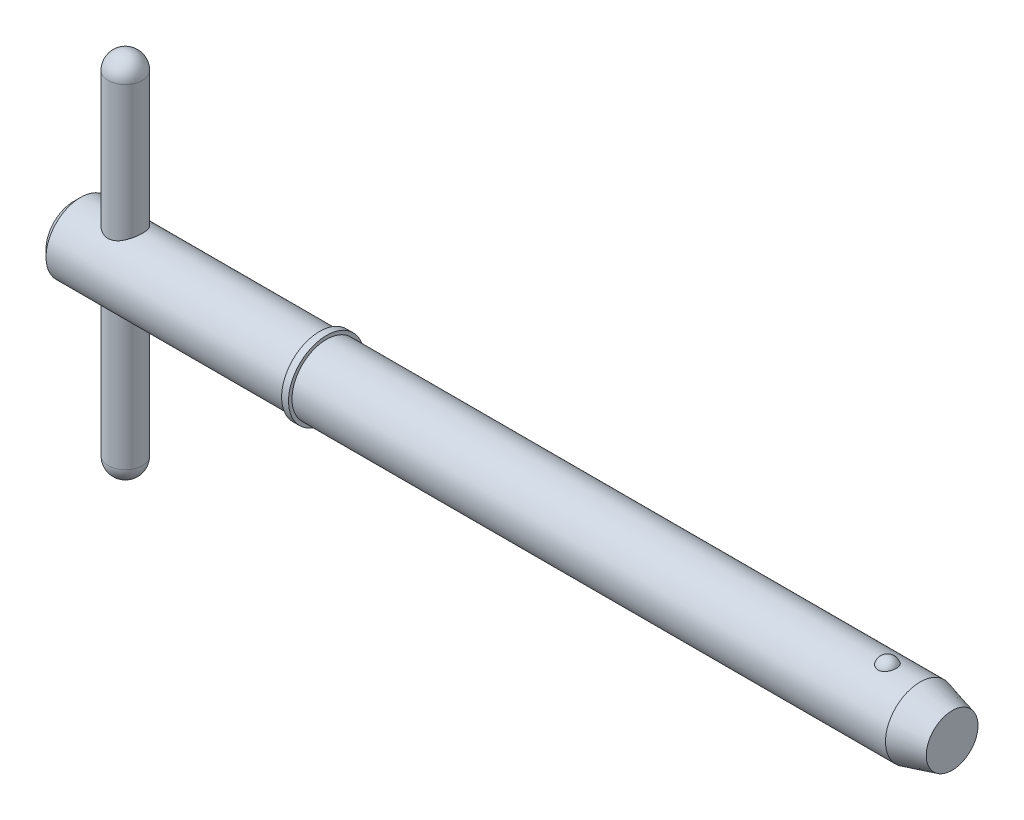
ISO-10303-21;
HEADER;
FILE_DESCRIPTION(('STEP AP214'),'2;1');
FILE_NAME('part.step','',(''),(''),'','','');
FILE_SCHEMA(('AUTOMOTIVE_DESIGN { 1 0 10303 214 1 1 1 1 }'));
ENDSEC;
DATA;
#1=APPLICATION_CONTEXT('core data for automotive mechanical design processes');
#2=APPLICATION_PROTOCOL_DEFINITION('international standard','automotive_design',2000,#1);
#3=PRODUCT_CONTEXT('',#1,'mechanical');
#4=PRODUCT('Part','Part','',(#3));
#5=PRODUCT_RELATED_PRODUCT_CATEGORY('part','',(#4));
#6=PRODUCT_DEFINITION_FORMATION('','',#4);
#7=PRODUCT_DEFINITION_CONTEXT('part definition',#1,'design');
#8=PRODUCT_DEFINITION('design','',#6,#7);
#9=PRODUCT_DEFINITION_SHAPE('','',#8);
#10=(LENGTH_UNIT() NAMED_UNIT(*) SI_UNIT(.MILLI.,.METRE.));
#11=(NAMED_UNIT(*) PLANE_ANGLE_UNIT() SI_UNIT($,.RADIAN.));
#12=(NAMED_UNIT(*) SI_UNIT($,.STERADIAN.) SOLID_ANGLE_UNIT());
#13=UNCERTAINTY_MEASURE_WITH_UNIT(LENGTH_MEASURE(1.E-05),#10,'distance_accuracy_value','');
#14=(GEOMETRIC_REPRESENTATION_CONTEXT(3) GLOBAL_UNCERTAINTY_ASSIGNED_CONTEXT((#13)) GLOBAL_UNIT_ASSIGNED_CONTEXT((#10,
#11,#12)) REPRESENTATION_CONTEXT('',''));
#15=CARTESIAN_POINT('',(0.,0.,0.));
#16=DIRECTION('',(0.,0.,1.));
#17=DIRECTION('',(1.,0.,0.));
#18=AXIS2_PLACEMENT_3D('',#15,#16,#17);
#19=CARTESIAN_POINT('',(3.57,12.7,0.));
#20=DIRECTION('',(0.,-1.,0.));
#21=DIRECTION('',(0.,0.,-1.));
#22=AXIS2_PLACEMENT_3D('',#19,#20,#21);
#23=CYLINDRICAL_SURFACE('',#22,1.19);
#24=CARTESIAN_POINT('',(3.57,-11.51,0.));
#25=DIRECTION('',(0.,-1.,0.));
#26=DIRECTION('',(0.,0.,-1.));
#27=AXIS2_PLACEMENT_3D('',#24,#25,#26);
#28=CIRCLE('',#27,1.19);
#29=CARTESIAN_POINT('',(3.57,-11.51,-1.19));
#30=VERTEX_POINT('',#29);
#31=EDGE_CURVE('P0_E10',#30,#30,#28,.F.);
#32=ORIENTED_EDGE('',*,*,#31,.T.);
#33=EDGE_LOOP('',(#32));
#34=FACE_BOUND('',#33,.T.);
#35=CARTESIAN_POINT('',(3.57,11.51,0.));
#36=DIRECTION('',(0.,-1.,0.));
#37=DIRECTION('',(0.,0.,-1.));
#38=AXIS2_PLACEMENT_3D('',#35,#36,#37);
#39=CIRCLE('',#38,1.19);
#40=CARTESIAN_POINT('',(3.57,11.51,-1.19));
#41=VERTEX_POINT('',#40);
#42=EDGE_CURVE('P0_E21',#41,#41,#39,.T.);
#43=ORIENTED_EDGE('',*,*,#42,.T.);
#44=EDGE_LOOP('',(#43));
#45=FACE_BOUND('',#44,.T.);
#46=ADVANCED_FACE('P0_F14',(#34,#45),#23,.T.);
#47=CARTESIAN_POINT('',(3.57,-11.51,0.));
#48=DIRECTION('',(0.,0.,1.));
#49=DIRECTION('',(1.,0.,0.));
#50=AXIS2_PLACEMENT_3D('',#47,#48,#49);
#51=SPHERICAL_SURFACE('',#50,1.19);
#52=CARTESIAN_POINT('',(3.57,-11.51,0.));
#53=DIRECTION('',(0.,-1.,0.));
#54=DIRECTION('',(0.,0.,-1.));
#55=AXIS2_PLACEMENT_3D('',#52,#53,#54);
#56=SPHERICAL_SURFACE('',#55,1.19);
#57=ORIENTED_EDGE('',*,*,#31,.F.);
#58=EDGE_LOOP('',(#57));
#59=FACE_BOUND('',#58,.T.);
#60=ADVANCED_FACE('P0_F29',(#59),#56,.T.);
#61=CARTESIAN_POINT('',(3.57,11.51,0.));
#62=DIRECTION('',(0.,0.,1.));
#63=DIRECTION('',(1.,0.,0.));
#64=AXIS2_PLACEMENT_3D('',#61,#62,#63);
#65=SPHERICAL_SURFACE('',#64,1.19);
#66=CARTESIAN_POINT('',(3.57,11.51,0.));
#67=DIRECTION('',(0.,-1.,0.));
#68=DIRECTION('',(0.,0.,-1.));
#69=AXIS2_PLACEMENT_3D('',#66,#67,#68);
#70=SPHERICAL_SURFACE('',#69,1.19);
#71=ORIENTED_EDGE('',*,*,#42,.F.);
#72=EDGE_LOOP('',(#71));
#73=FACE_BOUND('',#72,.T.);
#74=ADVANCED_FACE('P0_F16',(#73),#70,.T.);
#75=CLOSED_SHELL('',(#46,#60,#74));
#76=MANIFOLD_SOLID_BREP('P0_B1',#75);
#77=CARTESIAN_POINT('',(0.,0.,0.));
#78=DIRECTION('',(1.,0.,0.));
#79=DIRECTION('',(0.,0.,-1.));
#80=AXIS2_PLACEMENT_3D('',#77,#78,#79);
#81=CYLINDRICAL_SURFACE('',#80,2.38);
#82=CARTESIAN_POINT('',(58.4094297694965,0.,0.));
#83=DIRECTION('',(1.,0.,0.));
#84=DIRECTION('',(0.,0.,-1.));
#85=AXIS2_PLACEMENT_3D('',#82,#83,#84);
#86=CIRCLE('',#85,2.38);
#87=CARTESIAN_POINT('',(58.4094297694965,0.,-2.38));
#88=VERTEX_POINT('',#87);
#89=EDGE_CURVE('P1_E81',#88,#88,#86,.T.);
#90=ORIENTED_EDGE('',*,*,#89,.F.);
#91=EDGE_LOOP('',(#90));
#92=FACE_BOUND('',#91,.T.);
#93=CARTESIAN_POINT('',(17.45,0.,0.));
#94=DIRECTION('',(1.,0.,0.));
#95=DIRECTION('',(0.,0.,-1.));
#96=AXIS2_PLACEMENT_3D('',#93,#94,#95);
#97=CIRCLE('',#96,2.38);
#98=CARTESIAN_POINT('',(17.45,0.,-2.38));
#99=VERTEX_POINT('',#98);
#100=EDGE_CURVE('P1_E85',#99,#99,#97,.T.);
#101=ORIENTED_EDGE('',*,*,#100,.T.);
#102=EDGE_LOOP('',(#101));
#103=FACE_BOUND('',#102,.T.);
#104=CARTESIAN_POINT('',(56.1634492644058,2.2921568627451,0.640637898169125));
#105=CARTESIAN_POINT('',(56.1303559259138,2.29215737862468,0.640637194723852));
#106=CARTESIAN_POINT('',(56.0972546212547,2.29293179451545,0.637884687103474));
#107=CARTESIAN_POINT('',(56.0320176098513,2.29594030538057,0.626968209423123));
#108=CARTESIAN_POINT('',(55.9998823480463,2.29817506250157,0.618801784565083));
#109=CARTESIAN_POINT('',(55.9375402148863,2.30384308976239,0.597351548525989));
#110=CARTESIAN_POINT('',(55.9073305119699,2.30727454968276,0.584075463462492));
#111=CARTESIAN_POINT('',(55.8495674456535,2.31495941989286,0.552829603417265));
#112=CARTESIAN_POINT('',(55.8220141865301,2.31921286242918,0.534859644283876));
#113=CARTESIAN_POINT('',(55.7695938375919,2.32820213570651,0.494282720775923));
#114=CARTESIAN_POINT('',(55.7448050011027,2.33294694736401,0.471576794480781));
#115=CARTESIAN_POINT('',(55.6992169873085,2.34234144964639,0.422446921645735));
#116=CARTESIAN_POINT('',(55.6784185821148,2.34699112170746,0.396022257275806));
#117=CARTESIAN_POINT('',(55.6403580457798,2.35593942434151,0.338855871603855));
#118=CARTESIAN_POINT('',(55.6233051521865,2.36021170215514,0.30797060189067));
#119=CARTESIAN_POINT('',(55.5943607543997,2.3677057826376,0.243750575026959));
#120=CARTESIAN_POINT('',(55.5824701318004,2.37092740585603,0.210415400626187));
#121=CARTESIAN_POINT('',(55.5638076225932,2.37606901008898,0.141189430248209));
#122=CARTESIAN_POINT('',(55.5571956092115,2.37794816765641,0.105252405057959));
#123=CARTESIAN_POINT('',(55.5498095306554,2.38005135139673,0.0327351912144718));
#124=CARTESIAN_POINT('',(55.5490358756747,2.38027526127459,-0.00384504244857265));
#125=CARTESIAN_POINT('',(55.5533628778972,2.37903842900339,-0.0769838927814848));
#126=CARTESIAN_POINT('',(55.5585202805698,2.37756141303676,-0.113538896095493));
#127=CARTESIAN_POINT('',(55.5747013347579,2.37305303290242,-0.185229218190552));
#128=CARTESIAN_POINT('',(55.5857251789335,2.37002161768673,-0.220364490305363));
#129=CARTESIAN_POINT('',(55.6133977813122,2.36273722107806,-0.288156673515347));
#130=CARTESIAN_POINT('',(55.6300389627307,2.35848588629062,-0.32081685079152));
#131=CARTESIAN_POINT('',(55.6685984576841,2.34923130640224,-0.382744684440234));
#132=CARTESIAN_POINT('',(55.690516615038,2.34422808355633,-0.412012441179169));
#133=CARTESIAN_POINT('',(55.7387549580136,2.33412555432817,-0.465830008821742));
#134=CARTESIAN_POINT('',(55.765002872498,2.32902887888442,-0.490444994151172));
#135=CARTESIAN_POINT('',(55.8214769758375,2.31926941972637,-0.534700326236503));
#136=CARTESIAN_POINT('',(55.851702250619,2.3146065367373,-0.554341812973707));
#137=CARTESIAN_POINT('',(55.9140618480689,2.30645675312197,-0.58731242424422));
#138=CARTESIAN_POINT('',(55.9460780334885,2.30293152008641,-0.600855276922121));
#139=CARTESIAN_POINT('',(56.0120795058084,2.29725171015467,-0.622220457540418));
#140=CARTESIAN_POINT('',(56.0460641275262,2.29509667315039,-0.630044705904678));
#141=CARTESIAN_POINT('',(56.113299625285,2.29249264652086,-0.639452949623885));
#142=CARTESIAN_POINT('',(56.1465087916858,2.29196755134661,-0.641315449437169));
#143=CARTESIAN_POINT('',(56.2127631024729,2.29246849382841,-0.639522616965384));
#144=CARTESIAN_POINT('',(56.2458082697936,2.29349430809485,-0.635868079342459));
#145=CARTESIAN_POINT('',(56.3101025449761,2.29694059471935,-0.623301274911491));
#146=CARTESIAN_POINT('',(56.3413744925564,2.29933234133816,-0.61449721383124));
#147=CARTESIAN_POINT('',(56.4019952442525,2.30522511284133,-0.592006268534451));
#148=CARTESIAN_POINT('',(56.4313438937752,2.30872622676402,-0.578318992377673));
#149=CARTESIAN_POINT('',(56.4880369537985,2.31655795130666,-0.546112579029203));
#150=CARTESIAN_POINT('',(56.515320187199,2.32090569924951,-0.527490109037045));
#151=CARTESIAN_POINT('',(56.5664904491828,2.32992206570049,-0.486117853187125));
#152=CARTESIAN_POINT('',(56.5903767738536,2.33459075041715,-0.463367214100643));
#153=CARTESIAN_POINT('',(56.6352722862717,2.34399834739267,-0.413220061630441));
#154=CARTESIAN_POINT('',(56.6560972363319,2.34873051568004,-0.385657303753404));
#155=CARTESIAN_POINT('',(56.693056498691,2.35754932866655,-0.327455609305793));
#156=CARTESIAN_POINT('',(56.7091898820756,2.36163584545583,-0.29681606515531));
#157=CARTESIAN_POINT('',(56.7369822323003,2.36889321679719,-0.232047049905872));
#158=CARTESIAN_POINT('',(56.7484450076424,2.37202275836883,-0.197828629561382));
#159=CARTESIAN_POINT('',(56.7657523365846,2.37681926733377,-0.127900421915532));
#160=CARTESIAN_POINT('',(56.7715962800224,2.37848607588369,-0.0921904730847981));
#161=CARTESIAN_POINT('',(56.777605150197,2.38020024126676,-0.0196348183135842));
#162=CARTESIAN_POINT('',(56.7776704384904,2.38021918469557,0.0172198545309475));
#163=CARTESIAN_POINT('',(56.7718689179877,2.37856356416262,0.0904219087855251));
#164=CARTESIAN_POINT('',(56.7660018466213,2.37688892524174,0.126769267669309));
#165=CARTESIAN_POINT('',(56.748425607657,2.37201688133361,0.198028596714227));
#166=CARTESIAN_POINT('',(56.736699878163,2.36881516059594,0.232936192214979));
#167=CARTESIAN_POINT('',(56.7076354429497,2.36123444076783,0.300196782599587));
#168=CARTESIAN_POINT('',(56.6902967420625,2.3568554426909,0.332549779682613));
#169=CARTESIAN_POINT('',(56.6505350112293,2.34744667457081,0.393495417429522));
#170=CARTESIAN_POINT('',(56.6281528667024,2.34242227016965,0.422115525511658));
#171=CARTESIAN_POINT('',(56.5787391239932,2.33227293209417,0.475004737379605));
#172=CARTESIAN_POINT('',(56.5517076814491,2.32714800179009,0.499273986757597));
#173=CARTESIAN_POINT('',(56.4944988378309,2.31755359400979,0.54204602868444));
#174=CARTESIAN_POINT('',(56.4644297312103,2.3130698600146,0.560690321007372));
#175=CARTESIAN_POINT('',(56.4013869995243,2.3051412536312,0.592447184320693));
#176=CARTESIAN_POINT('',(56.3684158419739,2.30169550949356,0.605564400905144));
#177=CARTESIAN_POINT('',(56.3068424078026,2.29677744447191,0.623927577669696));
#178=CARTESIAN_POINT('',(56.2785555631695,2.29505839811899,0.63017893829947));
#179=CARTESIAN_POINT('',(56.2213308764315,2.29274795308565,0.638534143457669));
#180=CARTESIAN_POINT('',(56.1923931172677,2.29215641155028,0.640638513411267));
#181=CARTESIAN_POINT('',(56.1634492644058,2.2921568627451,0.640637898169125));
#182=B_SPLINE_CURVE_WITH_KNOTS('',3,(#104,#105,#106,#107,#108,#109,#110,#111,#112,#113,#114,
#115,#116,#117,#118,#119,#120,#121,#122,#123,#124,#125,#126,#127,#128,#129,#130,#131,#132,#133,
#134,#135,#136,#137,#138,#139,#140,#141,#142,#143,#144,#145,#146,#147,#148,#149,#150,#151,#152,
#153,#154,#155,#156,#157,#158,#159,#160,#161,#162,#163,#164,#165,#166,#167,#168,#169,#170,#171,
#172,#173,#174,#175,#176,#177,#178,#179,#180,#181),.UNSPECIFIED.,.T.,.F.,(4,2,2,2,2,2,2,2,2,2,2,
2,2,2,2,2,2,2,2,2,2,2,2,2,2,2,2,2,2,2,2,2,2,2,2,2,2,2,4),(0.,0.0991724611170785,
0.198389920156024,0.297457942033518,0.396529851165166,0.497927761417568,0.599345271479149,
0.705475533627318,0.811623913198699,0.92087671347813,1.03013718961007,1.14045177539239,
1.25076998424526,1.36093998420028,1.47110672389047,1.57959248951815,1.6880533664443,
1.79234266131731,1.89659691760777,1.9959039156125,2.09519661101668,2.1924742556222,
2.28975970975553,2.38926978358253,2.48880044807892,2.59293588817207,2.6970919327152,
2.8052582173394,2.91343624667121,3.02347917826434,3.13352698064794,3.24388765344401,
3.35424823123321,3.46374443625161,3.57323697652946,3.67968690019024,3.78604717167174,
3.87279565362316,3.95953314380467),.UNSPECIFIED.);
#183=CARTESIAN_POINT('',(56.1634492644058,2.2921568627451,0.640637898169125));
#184=VERTEX_POINT('',#183);
#185=EDGE_CURVE('P1_E35',#184,#184,#182,.T.);
#186=ORIENTED_EDGE('',*,*,#185,.T.);
#187=EDGE_LOOP('',(#186));
#188=FACE_BOUND('',#187,.T.);
#189=ADVANCED_FACE('P1_F13',(#92,#103,#188),#81,.T.);
#190=CARTESIAN_POINT('',(0.,0.,0.));
#191=DIRECTION('',(-1.,0.,0.));
#192=DIRECTION('',(0.,0.,1.));
#193=AXIS2_PLACEMENT_3D('',#190,#191,#192);
#194=PLANE('',#193);
#195=CARTESIAN_POINT('',(0.,0.,0.));
#196=DIRECTION('',(1.,0.,0.));
#197=DIRECTION('',(0.,0.,-1.));
#198=AXIS2_PLACEMENT_3D('',#195,#196,#197);
#199=CIRCLE('',#198,1.904);
#200=CARTESIAN_POINT('',(0.,0.,-1.904));
#201=VERTEX_POINT('',#200);
#202=EDGE_CURVE('P1_E9',#201,#201,#199,.T.);
#203=ORIENTED_EDGE('',*,*,#202,.F.);
#204=EDGE_LOOP('',(#203));
#205=FACE_BOUND('',#204,.T.);
#206=ADVANCED_FACE('P1_F15',(#205),#194,.T.);
#207=CARTESIAN_POINT('',(0.475999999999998,0.,0.));
#208=DIRECTION('',(1.,0.,0.));
#209=DIRECTION('',(0.,0.,-1.));
#210=AXIS2_PLACEMENT_3D('',#207,#208,#209);
#211=CONICAL_SURFACE('',#210,2.38,0.78539816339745);
#212=ORIENTED_EDGE('',*,*,#202,.T.);
#213=EDGE_LOOP('',(#212));
#214=FACE_BOUND('',#213,.T.);
#215=CARTESIAN_POINT('',(0.475999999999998,0.,0.));
#216=DIRECTION('',(1.,0.,0.));
#217=DIRECTION('',(0.,0.,-1.));
#218=AXIS2_PLACEMENT_3D('',#215,#216,#217);
#219=CIRCLE('',#218,2.38);
#220=CARTESIAN_POINT('',(0.475999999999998,0.,-2.38));
#221=VERTEX_POINT('',#220);
#222=EDGE_CURVE('P1_E26',#221,#221,#219,.T.);
#223=ORIENTED_EDGE('',*,*,#222,.F.);
#224=EDGE_LOOP('',(#223));
#225=FACE_BOUND('',#224,.T.);
#226=ADVANCED_FACE('P1_F77',(#214,#225),#211,.T.);
#227=CARTESIAN_POINT('',(0.,0.,0.));
#228=DIRECTION('',(1.,0.,0.));
#229=DIRECTION('',(0.,0.,-1.));
#230=AXIS2_PLACEMENT_3D('',#227,#228,#229);
#231=CYLINDRICAL_SURFACE('',#230,2.38);
#232=CARTESIAN_POINT('',(3.57,-2.06114046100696,1.19));
#233=CARTESIAN_POINT('',(3.50799170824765,-2.06114586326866,1.18999567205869));
#234=CARTESIAN_POINT('',(3.4459051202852,-2.0639812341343,1.18512096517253));
#235=CARTESIAN_POINT('',(3.32363755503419,-2.07491216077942,1.16587061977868));
#236=CARTESIAN_POINT('',(3.26346086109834,-2.08301876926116,1.15147501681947));
#237=CARTESIAN_POINT('',(3.14701251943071,-2.10331722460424,1.11395893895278));
#238=CARTESIAN_POINT('',(3.09072196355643,-2.1154873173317,1.09088484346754));
#239=CARTESIAN_POINT('',(2.9828251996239,-2.14250771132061,1.03680835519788));
#240=CARTESIAN_POINT('',(2.93121924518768,-2.15735815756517,1.00580553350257));
#241=CARTESIAN_POINT('',(2.82945618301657,-2.18956274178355,0.933753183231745));
#242=CARTESIAN_POINT('',(2.77976962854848,-2.20702235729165,0.892085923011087));
#243=CARTESIAN_POINT('',(2.68772401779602,-2.2416265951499,0.801172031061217));
#244=CARTESIAN_POINT('',(2.64536861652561,-2.25877105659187,0.751921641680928));
#245=CARTESIAN_POINT('',(2.56639309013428,-2.29219557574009,0.64318258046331));
#246=CARTESIAN_POINT('',(2.53035201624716,-2.30833946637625,0.583227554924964));
#247=CARTESIAN_POINT('',(2.46908238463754,-2.3365739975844,0.45714686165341));
#248=CARTESIAN_POINT('',(2.44384700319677,-2.34866719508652,0.391025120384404));
#249=CARTESIAN_POINT('',(2.40676945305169,-2.36667748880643,0.259473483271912));
#250=CARTESIAN_POINT('',(2.39410206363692,-2.37297281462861,0.194329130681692));
#251=CARTESIAN_POINT('',(2.3798023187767,-2.3800902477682,0.0625590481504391));
#252=CARTESIAN_POINT('',(2.37816328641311,-2.38091566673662,-0.00406576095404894));
#253=CARTESIAN_POINT('',(2.38564854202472,-2.37717948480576,-0.130700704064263));
#254=CARTESIAN_POINT('',(2.39384923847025,-2.37308010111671,-0.190782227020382));
#255=CARTESIAN_POINT('',(2.41912820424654,-2.360653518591,-0.308583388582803));
#256=CARTESIAN_POINT('',(2.43620713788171,-2.35232600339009,-0.366302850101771));
#257=CARTESIAN_POINT('',(2.47886825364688,-2.33206184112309,-0.478748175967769));
#258=CARTESIAN_POINT('',(2.50456481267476,-2.32007685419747,-0.533421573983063));
#259=CARTESIAN_POINT('',(2.56357346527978,-2.29357798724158,-0.637812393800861));
#260=CARTESIAN_POINT('',(2.5968882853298,-2.27906320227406,-0.687528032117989));
#261=CARTESIAN_POINT('',(2.67380546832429,-2.24724829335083,-0.785606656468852));
#262=CARTESIAN_POINT('',(2.71808260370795,-2.22981457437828,-0.833397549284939));
#263=CARTESIAN_POINT('',(2.81386177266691,-2.19500665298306,-0.921184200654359));
#264=CARTESIAN_POINT('',(2.86536931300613,-2.17763250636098,-0.961173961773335));
#265=CARTESIAN_POINT('',(2.97815134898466,-2.14371545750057,-1.03471134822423));
#266=CARTESIAN_POINT('',(3.03983836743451,-2.12729540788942,-1.06768860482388));
#267=CARTESIAN_POINT('',(3.16889582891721,-2.09886785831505,-1.12254974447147));
#268=CARTESIAN_POINT('',(3.2362602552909,-2.0868557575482,-1.14444520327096));
#269=CARTESIAN_POINT('',(3.36914526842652,-2.06994116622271,-1.1747444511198));
#270=CARTESIAN_POINT('',(3.43438893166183,-2.06455070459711,-1.18407989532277));
#271=CARTESIAN_POINT('',(3.56571759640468,-2.06010324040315,-1.1918051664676));
#272=CARTESIAN_POINT('',(3.63180197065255,-2.06104176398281,-1.19020272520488));
#273=CARTESIAN_POINT('',(3.75522816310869,-2.06862860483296,-1.17695289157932));
#274=CARTESIAN_POINT('',(3.81273554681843,-2.07464109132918,-1.16642350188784));
#275=CARTESIAN_POINT('',(3.92505766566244,-2.09075885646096,-1.1372785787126));
#276=CARTESIAN_POINT('',(3.97987152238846,-2.1008654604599,-1.1186604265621));
#277=CARTESIAN_POINT('',(4.08813948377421,-2.12458104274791,-1.07296063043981));
#278=CARTESIAN_POINT('',(4.14141303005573,-2.13833055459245,-1.04552693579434));
#279=CARTESIAN_POINT('',(4.2429084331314,-2.16765782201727,-0.983281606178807));
#280=CARTESIAN_POINT('',(4.29112767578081,-2.18323651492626,-0.948466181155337));
#281=CARTESIAN_POINT('',(4.38750473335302,-2.2168271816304,-0.867316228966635));
#282=CARTESIAN_POINT('',(4.43488860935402,-2.23489833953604,-0.82008287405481));
#283=CARTESIAN_POINT('',(4.52130056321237,-2.26973739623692,-0.718051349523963));
#284=CARTESIAN_POINT('',(4.56032581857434,-2.28650485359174,-0.663250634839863));
#285=CARTESIAN_POINT('',(4.62978273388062,-2.31742220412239,-0.545657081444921));
#286=CARTESIAN_POINT('',(4.65996041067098,-2.33149133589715,-0.482691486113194));
#287=CARTESIAN_POINT('',(4.7089941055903,-2.35481192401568,-0.351671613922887));
#288=CARTESIAN_POINT('',(4.7278600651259,-2.36406760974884,-0.283621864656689));
#289=CARTESIAN_POINT('',(4.75210859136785,-2.3760433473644,-0.151105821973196));
#290=CARTESIAN_POINT('',(4.75856947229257,-2.37928514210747,-0.0868836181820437));
#291=CARTESIAN_POINT('',(4.76100348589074,-2.38050135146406,0.0417999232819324));
#292=CARTESIAN_POINT('',(4.75698028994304,-2.37847760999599,0.106261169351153));
#293=CARTESIAN_POINT('',(4.73927447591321,-2.36969422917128,0.229120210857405));
#294=CARTESIAN_POINT('',(4.72624582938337,-2.36325544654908,0.287637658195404));
#295=CARTESIAN_POINT('',(4.69178087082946,-2.34658591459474,0.401560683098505));
#296=CARTESIAN_POINT('',(4.67034335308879,-2.33635462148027,0.456965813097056));
#297=CARTESIAN_POINT('',(4.61871480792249,-2.31247857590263,0.565753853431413));
#298=CARTESIAN_POINT('',(4.58818860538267,-2.29870654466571,0.618948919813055));
#299=CARTESIAN_POINT('',(4.51967006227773,-2.26918878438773,0.719681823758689));
#300=CARTESIAN_POINT('',(4.48167429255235,-2.25344215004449,0.76721704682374));
#301=CARTESIAN_POINT('',(4.39491140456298,-2.21969046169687,0.860267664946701));
#302=CARTESIAN_POINT('',(4.34544863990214,-2.20161660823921,0.905111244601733));
#303=CARTESIAN_POINT('',(4.23943364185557,-2.16655060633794,0.986109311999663));
#304=CARTESIAN_POINT('',(4.18287520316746,-2.1495594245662,1.02225611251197));
#305=CARTESIAN_POINT('',(4.06190239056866,-2.1181953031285,1.08579298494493));
#306=CARTESIAN_POINT('',(3.9972962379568,-2.10392207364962,1.11287022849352));
#307=CARTESIAN_POINT('',(3.86353443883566,-2.08090726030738,1.15534566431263));
#308=CARTESIAN_POINT('',(3.7943948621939,-2.07214719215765,1.17078291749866));
#309=CARTESIAN_POINT('',(3.69875162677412,-2.06499834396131,1.18329673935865));
#310=CARTESIAN_POINT('',(3.67309220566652,-2.06355673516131,1.18580656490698));
#311=CARTESIAN_POINT('',(3.62162638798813,-2.06162663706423,1.18915915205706));
#312=CARTESIAN_POINT('',(3.59581998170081,-2.0611382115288,1.19000180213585));
#313=CARTESIAN_POINT('',(3.57,-2.06114046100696,1.19));
#314=B_SPLINE_CURVE_WITH_KNOTS('',3,(#232,#233,#234,#235,#236,#237,#238,#239,#240,#241,#242,
#243,#244,#245,#246,#247,#248,#249,#250,#251,#252,#253,#254,#255,#256,#257,#258,#259,#260,#261,
#262,#263,#264,#265,#266,#267,#268,#269,#270,#271,#272,#273,#274,#275,#276,#277,#278,#279,#280,
#281,#282,#283,#284,#285,#286,#287,#288,#289,#290,#291,#292,#293,#294,#295,#296,#297,#298,#299,
#300,#301,#302,#303,#304,#305,#306,#307,#308,#309,#310,#311,#312,#313),.UNSPECIFIED.,.T.,.F.,(4,
2,2,2,2,2,2,2,2,2,2,2,2,2,2,2,2,2,2,2,2,2,2,2,2,2,2,2,2,2,2,2,2,2,2,2,2,2,2,2,4),(0.,
0.185916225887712,0.372223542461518,0.557549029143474,0.742884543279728,0.943506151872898,
1.14422749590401,1.35847891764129,1.5725948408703,1.77147547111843,1.97023568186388,
2.15171156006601,2.33320101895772,2.51720146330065,2.70126786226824,2.902733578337,
3.10435357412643,3.31877721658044,3.53297641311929,3.73020126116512,3.92728670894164,
4.1028127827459,4.27839572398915,4.46211082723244,4.64592048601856,4.8529002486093,
5.0599497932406,5.27246375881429,5.48479067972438,5.67763601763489,5.87041383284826,
6.05048865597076,6.23058930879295,6.41839293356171,6.60628297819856,6.8128718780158,
7.01964271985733,7.2329479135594,7.44553408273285,7.52294360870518,7.60035831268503),.UNSPECIFIED.);
#315=CARTESIAN_POINT('',(3.57,-2.06114046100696,1.19));
#316=VERTEX_POINT('',#315);
#317=EDGE_CURVE('P1_E17',#316,#316,#314,.T.);
#318=ORIENTED_EDGE('',*,*,#317,.F.);
#319=EDGE_LOOP('',(#318));
#320=FACE_BOUND('',#319,.T.);
#321=CARTESIAN_POINT('',(3.57,2.06114046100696,1.19));
#322=CARTESIAN_POINT('',(3.63200829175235,2.06114586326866,1.18999567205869));
#323=CARTESIAN_POINT('',(3.6940948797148,2.0639812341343,1.18512096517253));
#324=CARTESIAN_POINT('',(3.81636244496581,2.07491216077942,1.16587061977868));
#325=CARTESIAN_POINT('',(3.87653913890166,2.08301876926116,1.15147501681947));
#326=CARTESIAN_POINT('',(3.99298748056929,2.10331722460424,1.11395893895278));
#327=CARTESIAN_POINT('',(4.04927803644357,2.1154873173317,1.09088484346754));
#328=CARTESIAN_POINT('',(4.1571748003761,2.14250771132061,1.03680835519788));
#329=CARTESIAN_POINT('',(4.20878075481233,2.15735815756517,1.00580553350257));
#330=CARTESIAN_POINT('',(4.31054381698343,2.18956274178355,0.933753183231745));
#331=CARTESIAN_POINT('',(4.36023037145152,2.20702235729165,0.892085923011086));
#332=CARTESIAN_POINT('',(4.45227598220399,2.2416265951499,0.801172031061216));
#333=CARTESIAN_POINT('',(4.49463138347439,2.25877105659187,0.751921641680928));
#334=CARTESIAN_POINT('',(4.57360690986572,2.29219557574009,0.643182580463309));
#335=CARTESIAN_POINT('',(4.60964798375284,2.30833946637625,0.583227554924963));
#336=CARTESIAN_POINT('',(4.67091761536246,2.3365739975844,0.457146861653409));
#337=CARTESIAN_POINT('',(4.69615299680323,2.34866719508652,0.391025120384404));
#338=CARTESIAN_POINT('',(4.73323054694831,2.36667748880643,0.259473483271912));
#339=CARTESIAN_POINT('',(4.74589793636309,2.37297281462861,0.194329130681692));
#340=CARTESIAN_POINT('',(4.7601976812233,2.3800902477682,0.0625590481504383));
#341=CARTESIAN_POINT('',(4.76183671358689,2.38091566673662,-0.00406576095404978));
#342=CARTESIAN_POINT('',(4.75435145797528,2.37717948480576,-0.130700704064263));
#343=CARTESIAN_POINT('',(4.74615076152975,2.37308010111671,-0.190782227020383));
#344=CARTESIAN_POINT('',(4.72087179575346,2.360653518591,-0.308583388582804));
#345=CARTESIAN_POINT('',(4.70379286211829,2.35232600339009,-0.366302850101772));
#346=CARTESIAN_POINT('',(4.66113174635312,2.33206184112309,-0.478748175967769));
#347=CARTESIAN_POINT('',(4.63543518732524,2.32007685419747,-0.533421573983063));
#348=CARTESIAN_POINT('',(4.57642653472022,2.29357798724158,-0.637812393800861));
#349=CARTESIAN_POINT('',(4.5431117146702,2.27906320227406,-0.687528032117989));
#350=CARTESIAN_POINT('',(4.46619453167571,2.24724829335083,-0.785606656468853));
#351=CARTESIAN_POINT('',(4.42191739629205,2.22981457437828,-0.83339754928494));
#352=CARTESIAN_POINT('',(4.32613822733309,2.19500665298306,-0.921184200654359));
#353=CARTESIAN_POINT('',(4.27463068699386,2.17763250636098,-0.961173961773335));
#354=CARTESIAN_POINT('',(4.16184865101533,2.14371545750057,-1.03471134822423));
#355=CARTESIAN_POINT('',(4.10016163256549,2.12729540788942,-1.06768860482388));
#356=CARTESIAN_POINT('',(3.97110417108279,2.09886785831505,-1.12254974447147));
#357=CARTESIAN_POINT('',(3.9037397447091,2.0868557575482,-1.14444520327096));
#358=CARTESIAN_POINT('',(3.77085473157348,2.06994116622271,-1.1747444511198));
#359=CARTESIAN_POINT('',(3.70561106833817,2.06455070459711,-1.18407989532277));
#360=CARTESIAN_POINT('',(3.57428240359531,2.06010324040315,-1.1918051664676));
#361=CARTESIAN_POINT('',(3.50819802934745,2.06104176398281,-1.19020272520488));
#362=CARTESIAN_POINT('',(3.38477183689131,2.06862860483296,-1.17695289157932));
#363=CARTESIAN_POINT('',(3.32726445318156,2.07464109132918,-1.16642350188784));
#364=CARTESIAN_POINT('',(3.21494233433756,2.09075885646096,-1.1372785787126));
#365=CARTESIAN_POINT('',(3.16012847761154,2.1008654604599,-1.1186604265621));
#366=CARTESIAN_POINT('',(3.05186051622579,2.12458104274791,-1.07296063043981));
#367=CARTESIAN_POINT('',(2.99858696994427,2.13833055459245,-1.04552693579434));
#368=CARTESIAN_POINT('',(2.8970915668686,2.16765782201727,-0.983281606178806));
#369=CARTESIAN_POINT('',(2.84887232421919,2.18323651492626,-0.948466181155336));
#370=CARTESIAN_POINT('',(2.75249526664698,2.2168271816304,-0.867316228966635));
#371=CARTESIAN_POINT('',(2.70511139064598,2.23489833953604,-0.820082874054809));
#372=CARTESIAN_POINT('',(2.61869943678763,2.26973739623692,-0.718051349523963));
#373=CARTESIAN_POINT('',(2.57967418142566,2.28650485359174,-0.663250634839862));
#374=CARTESIAN_POINT('',(2.51021726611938,2.31742220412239,-0.54565708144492));
#375=CARTESIAN_POINT('',(2.48003958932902,2.33149133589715,-0.482691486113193));
#376=CARTESIAN_POINT('',(2.4310058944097,2.35481192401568,-0.351671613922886));
#377=CARTESIAN_POINT('',(2.4121399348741,2.36406760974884,-0.283621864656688));
#378=CARTESIAN_POINT('',(2.38789140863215,2.3760433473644,-0.151105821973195));
#379=CARTESIAN_POINT('',(2.38143052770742,2.37928514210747,-0.0868836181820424));
#380=CARTESIAN_POINT('',(2.37899651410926,2.38050135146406,0.0417999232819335));
#381=CARTESIAN_POINT('',(2.38301971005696,2.37847760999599,0.106261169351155));
#382=CARTESIAN_POINT('',(2.40072552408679,2.36969422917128,0.229120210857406));
#383=CARTESIAN_POINT('',(2.41375417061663,2.36325544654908,0.287637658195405));
#384=CARTESIAN_POINT('',(2.44821912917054,2.34658591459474,0.401560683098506));
#385=CARTESIAN_POINT('',(2.46965664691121,2.33635462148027,0.456965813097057));
#386=CARTESIAN_POINT('',(2.52128519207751,2.31247857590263,0.565753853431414));
#387=CARTESIAN_POINT('',(2.55181139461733,2.29870654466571,0.618948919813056));
#388=CARTESIAN_POINT('',(2.62032993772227,2.26918878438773,0.719681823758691));
#389=CARTESIAN_POINT('',(2.65832570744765,2.25344215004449,0.767217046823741));
#390=CARTESIAN_POINT('',(2.74508859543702,2.21969046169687,0.860267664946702));
#391=CARTESIAN_POINT('',(2.79455136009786,2.20161660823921,0.905111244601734));
#392=CARTESIAN_POINT('',(2.90056635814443,2.16655060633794,0.986109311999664));
#393=CARTESIAN_POINT('',(2.95712479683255,2.1495594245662,1.02225611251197));
#394=CARTESIAN_POINT('',(3.07809760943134,2.1181953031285,1.08579298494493));
#395=CARTESIAN_POINT('',(3.1427037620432,2.10392207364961,1.11287022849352));
#396=CARTESIAN_POINT('',(3.27646556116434,2.08090726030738,1.15534566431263));
#397=CARTESIAN_POINT('',(3.3456051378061,2.07214719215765,1.17078291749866));
#398=CARTESIAN_POINT('',(3.44124837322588,2.06499834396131,1.18329673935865));
#399=CARTESIAN_POINT('',(3.46690779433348,2.06355673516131,1.18580656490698));
#400=CARTESIAN_POINT('',(3.51837361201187,2.06162663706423,1.18915915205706));
#401=CARTESIAN_POINT('',(3.54418001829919,2.0611382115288,1.19000180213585));
#402=CARTESIAN_POINT('',(3.57,2.06114046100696,1.19));
#403=B_SPLINE_CURVE_WITH_KNOTS('',3,(#321,#322,#323,#324,#325,#326,#327,#328,#329,#330,#331,
#332,#333,#334,#335,#336,#337,#338,#339,#340,#341,#342,#343,#344,#345,#346,#347,#348,#349,#350,
#351,#352,#353,#354,#355,#356,#357,#358,#359,#360,#361,#362,#363,#364,#365,#366,#367,#368,#369,
#370,#371,#372,#373,#374,#375,#376,#377,#378,#379,#380,#381,#382,#383,#384,#385,#386,#387,#388,
#389,#390,#391,#392,#393,#394,#395,#396,#397,#398,#399,#400,#401,#402),.UNSPECIFIED.,.T.,.F.,(4,
2,2,2,2,2,2,2,2,2,2,2,2,2,2,2,2,2,2,2,2,2,2,2,2,2,2,2,2,2,2,2,2,2,2,2,2,2,2,2,4),(0.,
0.185916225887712,0.372223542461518,0.557549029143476,0.74288454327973,0.9435061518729,
1.14422749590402,1.35847891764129,1.5725948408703,1.77147547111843,1.97023568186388,
2.15171156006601,2.33320101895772,2.51720146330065,2.70126786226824,2.902733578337,
3.10435357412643,3.31877721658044,3.53297641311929,3.73020126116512,3.92728670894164,
4.1028127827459,4.27839572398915,4.46211082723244,4.64592048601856,4.8529002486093,
5.05994979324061,5.27246375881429,5.48479067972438,5.67763601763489,5.87041383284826,
6.05048865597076,6.23058930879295,6.41839293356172,6.60628297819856,6.8128718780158,
7.01964271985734,7.2329479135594,7.44553408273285,7.52294360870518,7.60035831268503),.UNSPECIFIED.);
#404=CARTESIAN_POINT('',(3.57,2.06114046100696,1.19));
#405=VERTEX_POINT('',#404);
#406=EDGE_CURVE('P1_E43',#405,#405,#403,.T.);
#407=ORIENTED_EDGE('',*,*,#406,.F.);
#408=EDGE_LOOP('',(#407));
#409=FACE_BOUND('',#408,.T.);
#410=ORIENTED_EDGE('',*,*,#222,.T.);
#411=EDGE_LOOP('',(#410));
#412=FACE_BOUND('',#411,.T.);
#413=CARTESIAN_POINT('',(16.974,0.,0.));
#414=DIRECTION('',(1.,0.,0.));
#415=DIRECTION('',(0.,0.,-1.));
#416=AXIS2_PLACEMENT_3D('',#413,#414,#415);
#417=CIRCLE('',#416,2.38);
#418=CARTESIAN_POINT('',(16.974,0.,-2.38));
#419=VERTEX_POINT('',#418);
#420=EDGE_CURVE('P1_E31',#419,#419,#417,.T.);
#421=ORIENTED_EDGE('',*,*,#420,.F.);
#422=EDGE_LOOP('',(#421));
#423=FACE_BOUND('',#422,.T.);
#424=ADVANCED_FACE('P1_F103',(#320,#409,#412,#423),#231,.T.);
#425=CARTESIAN_POINT('',(16.974,2.38,0.));
#426=DIRECTION('',(-1.,0.,0.));
#427=DIRECTION('',(0.,0.,1.));
#428=AXIS2_PLACEMENT_3D('',#425,#426,#427);
#429=PLANE('',#428);
#430=ORIENTED_EDGE('',*,*,#420,.T.);
#431=EDGE_LOOP('',(#430));
#432=FACE_BOUND('',#431,.T.);
#433=CARTESIAN_POINT('',(16.974,0.,0.));
#434=DIRECTION('',(1.,0.,0.));
#435=DIRECTION('',(0.,0.,-1.));
#436=AXIS2_PLACEMENT_3D('',#433,#434,#435);
#437=CIRCLE('',#436,2.618);
#438=CARTESIAN_POINT('',(16.974,0.,-2.618));
#439=VERTEX_POINT('',#438);
#440=EDGE_CURVE('P1_E91',#439,#439,#437,.T.);
#441=ORIENTED_EDGE('',*,*,#440,.F.);
#442=EDGE_LOOP('',(#441));
#443=FACE_BOUND('',#442,.T.);
#444=ADVANCED_FACE('P1_F100',(#432,#443),#429,.T.);
#445=CARTESIAN_POINT('',(0.,0.,0.));
#446=DIRECTION('',(1.,0.,0.));
#447=DIRECTION('',(0.,0.,-1.));
#448=AXIS2_PLACEMENT_3D('',#445,#446,#447);
#449=CYLINDRICAL_SURFACE('',#448,2.618);
#450=ORIENTED_EDGE('',*,*,#440,.T.);
#451=EDGE_LOOP('',(#450));
#452=FACE_BOUND('',#451,.T.);
#453=CARTESIAN_POINT('',(17.45,0.,0.));
#454=DIRECTION('',(1.,0.,0.));
#455=DIRECTION('',(0.,0.,-1.));
#456=AXIS2_PLACEMENT_3D('',#453,#454,#455);
#457=CIRCLE('',#456,2.618);
#458=CARTESIAN_POINT('',(17.45,0.,-2.618));
#459=VERTEX_POINT('',#458);
#460=EDGE_CURVE('P1_E88',#459,#459,#457,.T.);
#461=ORIENTED_EDGE('',*,*,#460,.F.);
#462=EDGE_LOOP('',(#461));
#463=FACE_BOUND('',#462,.T.);
#464=ADVANCED_FACE('P1_F68',(#452,#463),#449,.T.);
#465=CARTESIAN_POINT('',(17.45,2.618,0.));
#466=DIRECTION('',(1.,0.,0.));
#467=DIRECTION('',(0.,0.,-1.));
#468=AXIS2_PLACEMENT_3D('',#465,#466,#467);
#469=PLANE('',#468);
#470=ORIENTED_EDGE('',*,*,#460,.T.);
#471=EDGE_LOOP('',(#470));
#472=FACE_BOUND('',#471,.T.);
#473=ORIENTED_EDGE('',*,*,#100,.F.);
#474=EDGE_LOOP('',(#473));
#475=FACE_BOUND('',#474,.T.);
#476=ADVANCED_FACE('P1_F62',(#472,#475),#469,.T.);
#477=CARTESIAN_POINT('',(60.63,0.,0.));
#478=DIRECTION('',(-1.,0.,0.));
#479=DIRECTION('',(0.,0.,1.));
#480=AXIS2_PLACEMENT_3D('',#477,#478,#479);
#481=CONICAL_SURFACE('',#480,1.78500000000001,0.261799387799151);
#482=ORIENTED_EDGE('',*,*,#89,.T.);
#483=EDGE_LOOP('',(#482));
#484=FACE_BOUND('',#483,.T.);
#485=CARTESIAN_POINT('',(60.63,0.,0.));
#486=DIRECTION('',(1.,0.,0.));
#487=DIRECTION('',(0.,0.,-1.));
#488=AXIS2_PLACEMENT_3D('',#485,#486,#487);
#489=CIRCLE('',#488,1.78500000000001);
#490=CARTESIAN_POINT('',(60.63,0.,-1.78500000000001));
#491=VERTEX_POINT('',#490);
#492=EDGE_CURVE('P1_E42',#491,#491,#489,.T.);
#493=ORIENTED_EDGE('',*,*,#492,.F.);
#494=EDGE_LOOP('',(#493));
#495=FACE_BOUND('',#494,.T.);
#496=ADVANCED_FACE('P1_F59',(#484,#495),#481,.T.);
#497=CARTESIAN_POINT('',(60.63,1.78500000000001,0.));
#498=DIRECTION('',(1.,0.,0.));
#499=DIRECTION('',(0.,0.,-1.));
#500=AXIS2_PLACEMENT_3D('',#497,#498,#499);
#501=PLANE('',#500);
#502=ORIENTED_EDGE('',*,*,#492,.T.);
#503=EDGE_LOOP('',(#502));
#504=FACE_BOUND('',#503,.T.);
#505=ADVANCED_FACE('P1_F55',(#504),#501,.T.);
#506=CARTESIAN_POINT('',(56.1634492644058,2.142,0.));
#507=DIRECTION('',(-1.,0.,0.));
#508=DIRECTION('',(0.,-1.,0.));
#509=AXIS2_PLACEMENT_3D('',#506,#507,#508);
#510=SPHERICAL_SURFACE('',#509,0.658000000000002);
#511=ORIENTED_EDGE('',*,*,#185,.F.);
#512=EDGE_LOOP('',(#511));
#513=FACE_BOUND('',#512,.T.);
#514=ADVANCED_FACE('P1_F50',(#513),#510,.T.);
#515=CARTESIAN_POINT('',(3.57,-2.618,0.));
#516=DIRECTION('',(0.,1.,0.));
#517=DIRECTION('',(0.,0.,1.));
#518=AXIS2_PLACEMENT_3D('',#515,#516,#517);
#519=CYLINDRICAL_SURFACE('',#518,1.19);
#520=ORIENTED_EDGE('',*,*,#317,.T.);
#521=EDGE_LOOP('',(#520));
#522=FACE_BOUND('',#521,.T.);
#523=ORIENTED_EDGE('',*,*,#406,.T.);
#524=EDGE_LOOP('',(#523));
#525=FACE_BOUND('',#524,.T.);
#526=ADVANCED_FACE('P1_F54',(#522,#525),#519,.F.);
#527=CLOSED_SHELL('',(#189,#206,#226,#424,#444,#464,#476,#496,#505,#514,#526));
#528=MANIFOLD_SOLID_BREP('P1_B1',#527);
#529=ADVANCED_BREP_SHAPE_REPRESENTATION('',(#18,#76,#528),#14);
#530=SHAPE_DEFINITION_REPRESENTATION(#9,#529);
ENDSEC;
END-ISO-10303-21;
